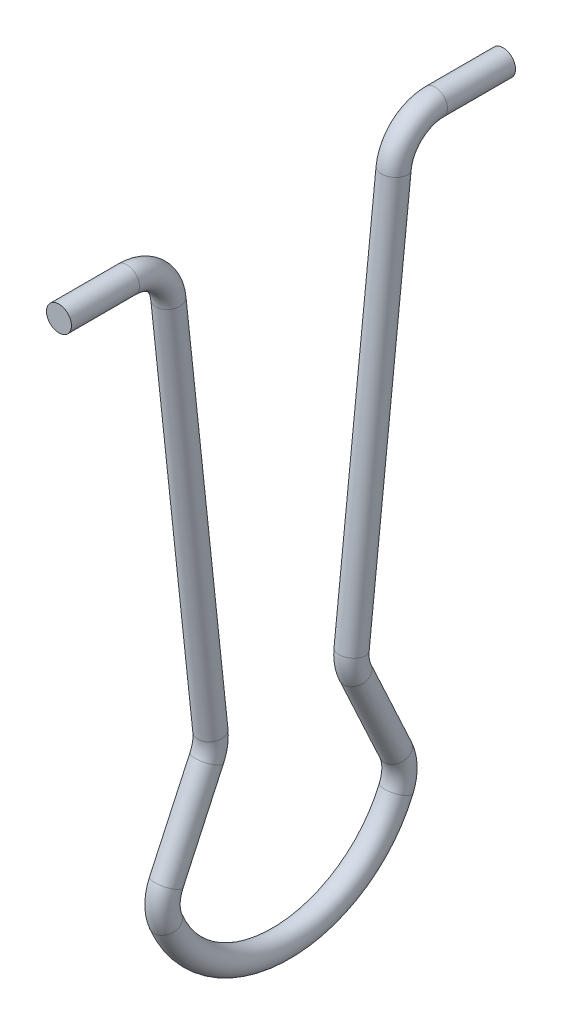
from build123d import *

# Parameters (mm, degrees)
SWEEP1_PROFILE_R = 0.9


with BuildPart() as part:
    # Sweep1: sweep along a path in Sketch1
    with BuildLine(Plane(origin=(0, 0, 0), x_dir=(0, 0, -1), z_dir=(1, 0, 0))) as sweep1_path:
        Line((16, 0), (11.098136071, 0))
        ThreePointArc((11.098136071, 0), (9.092007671, -0.769428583), (8.114927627, -2.683034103))
        Line((8.114927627, -2.683034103), (5.087573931, -31.175774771))
        ThreePointArc((5.087573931, -31.175774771), (5.110894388, -31.981681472), (5.34799422, -32.752274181))
        Line((5.34799422, -32.752274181), (8.260849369, -39.049119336))
        ThreePointArc((8.260849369, -39.049119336), (8.537510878, -40.251192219), (8.307091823, -41.462979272))
        ThreePointArc((8.307091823, -41.462979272), (0, -47), (-8.307091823, -41.462979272))
        ThreePointArc((-8.307091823, -41.462979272), (-8.537510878, -40.251192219), (-8.260849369, -39.049119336))
        Line((-8.260849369, -39.049119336), (-5.34799422, -32.752274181))
        ThreePointArc((-5.34799422, -32.752274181), (-5.110894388, -31.981681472), (-5.087573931, -31.175774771))
        Line((-5.087573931, -31.175774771), (-8.114927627, -2.683034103))
        ThreePointArc((-8.114927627, -2.683034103), (-9.092007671, -0.769428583), (-11.098136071, 0))
        Line((-11.098136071, 0), (-16, 0))
    # Sweep1 profile (on start of the path) → Sweep1 (sweep)
    with BuildSketch(Plane(origin=(0, 0, -16), x_dir=(0, 1, 0), z_dir=(0, 0, 1))):
        Circle(SWEEP1_PROFILE_R)
    sweep(path=sweep1_path.line)


solid = part.part
